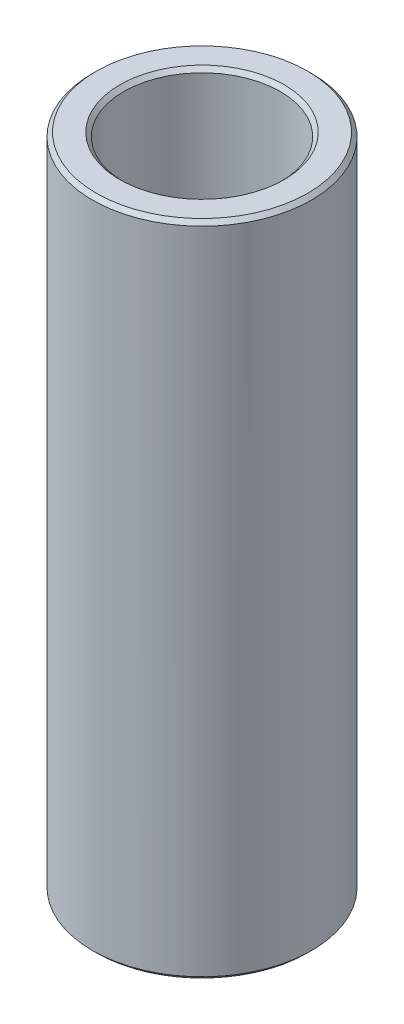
from build123d import *

# Parameters (mm, degrees)
SKETCH1_W     = 2
SKETCH1_H     = 42
CHAMFER1_SIZE = 0.25


with BuildPart() as part:
    # Sketch1 → Revolve1 (revolve)
    with BuildSketch(Plane.XY, mode=Mode.PRIVATE) as revolve1_sk:
        with Locations((-6, 21)):
            Rectangle(SKETCH1_W, SKETCH1_H)
    revolve(revolve1_sk.sketch.rotate(Axis((0, 0, 0), (0, 1, 0)), 270), axis=Axis((0, 0, 0), (0, 1, 0)))

    # Chamfer1
    chamfer1_edges = [part.edges().sort_by_distance(p)[0] for p in [
        (0, 0, 7),
        (0, 0, 5),
        (0, 42, 5),
        (0, 42, 7),
    ]]
    chamfer(chamfer1_edges, length=CHAMFER1_SIZE)


solid = part.part
